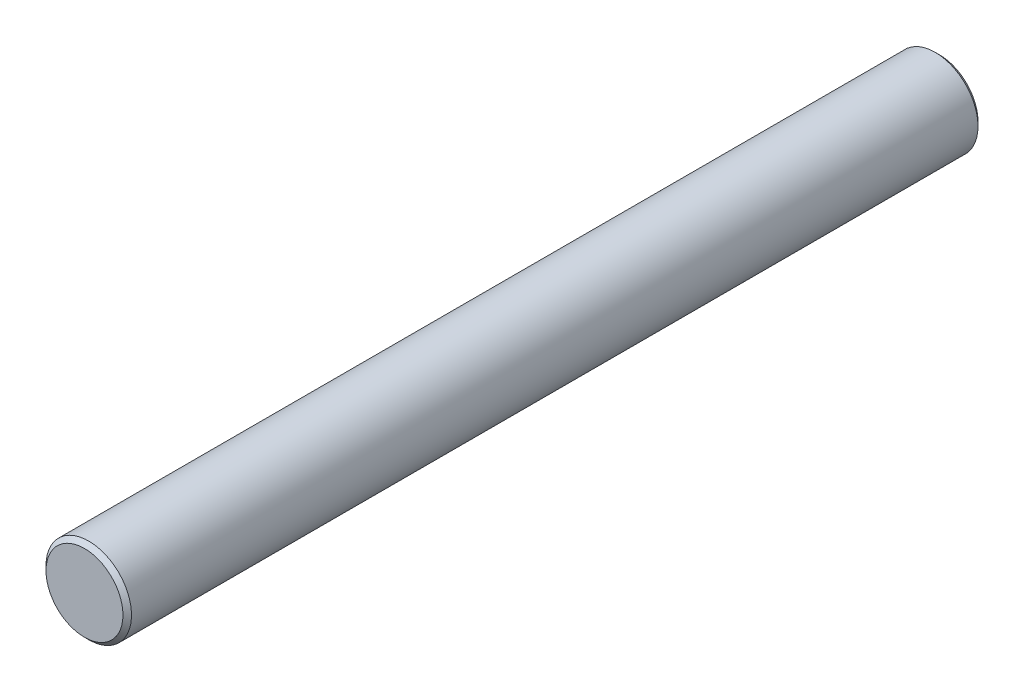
ISO-10303-21;
HEADER;
FILE_DESCRIPTION(('STEP AP214'),'2;1');
FILE_NAME('part.step','',(''),(''),'','','');
FILE_SCHEMA(('AUTOMOTIVE_DESIGN { 1 0 10303 214 1 1 1 1 }'));
ENDSEC;
DATA;
#1=APPLICATION_CONTEXT('core data for automotive mechanical design processes');
#2=APPLICATION_PROTOCOL_DEFINITION('international standard','automotive_design',2000,#1);
#3=PRODUCT_CONTEXT('',#1,'mechanical');
#4=PRODUCT('Part','Part','',(#3));
#5=PRODUCT_RELATED_PRODUCT_CATEGORY('part','',(#4));
#6=PRODUCT_DEFINITION_FORMATION('','',#4);
#7=PRODUCT_DEFINITION_CONTEXT('part definition',#1,'design');
#8=PRODUCT_DEFINITION('design','',#6,#7);
#9=PRODUCT_DEFINITION_SHAPE('','',#8);
#10=(LENGTH_UNIT() NAMED_UNIT(*) SI_UNIT(.MILLI.,.METRE.));
#11=(NAMED_UNIT(*) PLANE_ANGLE_UNIT() SI_UNIT($,.RADIAN.));
#12=(NAMED_UNIT(*) SI_UNIT($,.STERADIAN.) SOLID_ANGLE_UNIT());
#13=UNCERTAINTY_MEASURE_WITH_UNIT(LENGTH_MEASURE(1.E-05),#10,'distance_accuracy_value','');
#14=(GEOMETRIC_REPRESENTATION_CONTEXT(3) GLOBAL_UNCERTAINTY_ASSIGNED_CONTEXT((#13)) GLOBAL_UNIT_ASSIGNED_CONTEXT((#10,
#11,#12)) REPRESENTATION_CONTEXT('',''));
#15=CARTESIAN_POINT('',(0.,0.,0.));
#16=DIRECTION('',(0.,0.,1.));
#17=DIRECTION('',(1.,0.,0.));
#18=AXIS2_PLACEMENT_3D('',#15,#16,#17);
#19=CARTESIAN_POINT('',(0.,0.,100.));
#20=DIRECTION('',(0.,0.,-1.));
#21=DIRECTION('',(-1.,0.,0.));
#22=AXIS2_PLACEMENT_3D('',#19,#20,#21);
#23=CYLINDRICAL_SURFACE('',#22,5.);
#24=CARTESIAN_POINT('',(0.,0.,0.500000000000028));
#25=DIRECTION('',(0.,0.,1.));
#26=DIRECTION('',(1.,0.,0.));
#27=AXIS2_PLACEMENT_3D('',#24,#25,#26);
#28=CIRCLE('',#27,5.);
#29=CARTESIAN_POINT('',(-5.,0.,0.500000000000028));
#30=VERTEX_POINT('',#29);
#31=EDGE_CURVE('E356',#30,#30,#28,.T.);
#32=CARTESIAN_POINT('',(0.,0.,99.5));
#33=DIRECTION('',(0.,0.,1.));
#34=DIRECTION('',(1.,0.,0.));
#35=AXIS2_PLACEMENT_3D('',#32,#33,#34);
#36=CIRCLE('',#35,5.);
#37=CARTESIAN_POINT('',(-5.,0.,99.5));
#38=VERTEX_POINT('',#37);
#39=EDGE_CURVE('E360',#38,#38,#36,.F.);
#40=CARTESIAN_POINT('',(-5.,0.,0.500000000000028));
#41=CARTESIAN_POINT('',(-5.,0.,1.53125000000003));
#42=CARTESIAN_POINT('',(-5.,0.,2.56250000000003));
#43=CARTESIAN_POINT('',(-5.,0.,4.62500000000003));
#44=CARTESIAN_POINT('',(-5.,0.,5.65625000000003));
#45=CARTESIAN_POINT('',(-5.,0.,7.71875000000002));
#46=CARTESIAN_POINT('',(-5.,0.,8.75000000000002));
#47=CARTESIAN_POINT('',(-5.,0.,10.8125));
#48=CARTESIAN_POINT('',(-5.,0.,11.84375));
#49=CARTESIAN_POINT('',(-5.,0.,13.90625));
#50=CARTESIAN_POINT('',(-5.,0.,14.9375));
#51=CARTESIAN_POINT('',(-5.,0.,17.));
#52=CARTESIAN_POINT('',(-5.,0.,18.03125));
#53=CARTESIAN_POINT('',(-5.,0.,20.09375));
#54=CARTESIAN_POINT('',(-5.,0.,21.125));
#55=CARTESIAN_POINT('',(-5.,0.,23.1875));
#56=CARTESIAN_POINT('',(-5.,0.,24.21875));
#57=CARTESIAN_POINT('',(-5.,0.,26.28125));
#58=CARTESIAN_POINT('',(-5.,0.,27.3125));
#59=CARTESIAN_POINT('',(-5.,0.,29.375));
#60=CARTESIAN_POINT('',(-5.,0.,30.40625));
#61=CARTESIAN_POINT('',(-5.,0.,32.46875));
#62=CARTESIAN_POINT('',(-5.,0.,33.5));
#63=CARTESIAN_POINT('',(-5.,0.,35.5625));
#64=CARTESIAN_POINT('',(-5.,0.,36.59375));
#65=CARTESIAN_POINT('',(-5.,0.,38.65625));
#66=CARTESIAN_POINT('',(-5.,0.,39.6875));
#67=CARTESIAN_POINT('',(-5.,0.,41.75));
#68=CARTESIAN_POINT('',(-5.,0.,42.78125));
#69=CARTESIAN_POINT('',(-5.,0.,44.84375));
#70=CARTESIAN_POINT('',(-5.,0.,45.875));
#71=CARTESIAN_POINT('',(-5.,0.,47.9375));
#72=CARTESIAN_POINT('',(-5.,0.,48.96875));
#73=CARTESIAN_POINT('',(-5.,0.,51.03125));
#74=CARTESIAN_POINT('',(-5.,0.,52.0625));
#75=CARTESIAN_POINT('',(-5.,0.,54.125));
#76=CARTESIAN_POINT('',(-5.,0.,55.15625));
#77=CARTESIAN_POINT('',(-5.,0.,57.21875));
#78=CARTESIAN_POINT('',(-5.,0.,58.25));
#79=CARTESIAN_POINT('',(-5.,0.,60.3125));
#80=CARTESIAN_POINT('',(-5.,0.,61.34375));
#81=CARTESIAN_POINT('',(-5.,0.,63.40625));
#82=CARTESIAN_POINT('',(-5.,0.,64.4375));
#83=CARTESIAN_POINT('',(-5.,0.,66.5));
#84=CARTESIAN_POINT('',(-5.,0.,67.53125));
#85=CARTESIAN_POINT('',(-5.,0.,69.59375));
#86=CARTESIAN_POINT('',(-5.,0.,70.625));
#87=CARTESIAN_POINT('',(-5.,0.,72.6875));
#88=CARTESIAN_POINT('',(-5.,0.,73.71875));
#89=CARTESIAN_POINT('',(-5.,0.,75.78125));
#90=CARTESIAN_POINT('',(-5.,0.,76.8125));
#91=CARTESIAN_POINT('',(-5.,0.,78.875));
#92=CARTESIAN_POINT('',(-5.,0.,79.90625));
#93=CARTESIAN_POINT('',(-5.,0.,81.96875));
#94=CARTESIAN_POINT('',(-5.,0.,83.));
#95=CARTESIAN_POINT('',(-5.,0.,85.0625));
#96=CARTESIAN_POINT('',(-5.,0.,86.09375));
#97=CARTESIAN_POINT('',(-5.,0.,88.15625));
#98=CARTESIAN_POINT('',(-5.,0.,89.1875));
#99=CARTESIAN_POINT('',(-5.,0.,91.25));
#100=CARTESIAN_POINT('',(-5.,0.,92.28125));
#101=CARTESIAN_POINT('',(-5.,0.,94.34375));
#102=CARTESIAN_POINT('',(-5.,0.,95.375));
#103=CARTESIAN_POINT('',(-5.,0.,97.4375));
#104=CARTESIAN_POINT('',(-5.,0.,98.46875));
#105=CARTESIAN_POINT('',(-5.,0.,99.5));
#106=B_SPLINE_CURVE_WITH_KNOTS('',3,(#40,#41,#42,#43,#44,#45,#46,#47,#48,#49,#50,#51,#52,#53,
#54,#55,#56,#57,#58,#59,#60,#61,#62,#63,#64,#65,#66,#67,#68,#69,#70,#71,#72,#73,#74,#75,#76,#77,
#78,#79,#80,#81,#82,#83,#84,#85,#86,#87,#88,#89,#90,#91,#92,#93,#94,#95,#96,#97,#98,#99,#100,
#101,#102,#103,#104,#105),.UNSPECIFIED.,.F.,.F.,(4,2,2,2,2,2,2,2,2,2,2,2,2,2,2,2,2,2,2,2,2,2,2,
2,2,2,2,2,2,2,2,2,4),(0.,3.09375000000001,6.1875,9.28124999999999,12.375,15.46875,18.5625,
21.65625,24.75,27.84375,30.9375,34.03125,37.125,40.21875,43.3125,46.40625,49.5,52.59375,55.6875,
58.78125,61.875,64.96875,68.0625,71.15625,74.25,77.34375,80.4375,83.53125,86.625,89.71875,
92.8125,95.90625,99.),.UNSPECIFIED.);
#107=EDGE_CURVE('BSEAM346',#30,#38,#106,.T.);
#108=ORIENTED_EDGE('',*,*,#31,.T.);
#109=ORIENTED_EDGE('',*,*,#39,.T.);
#110=ORIENTED_EDGE('',*,*,#107,.T.);
#111=ORIENTED_EDGE('',*,*,#107,.F.);
#112=EDGE_LOOP('',(#108,#110,#109,#111));
#113=FACE_BOUND('',#112,.T.);
#114=ADVANCED_FACE('F346',(#113),#23,.T.);
#115=CARTESIAN_POINT('',(0.,0.,100.));
#116=DIRECTION('',(0.,0.,1.));
#117=DIRECTION('',(1.,0.,0.));
#118=AXIS2_PLACEMENT_3D('',#115,#116,#117);
#119=PLANE('',#118);
#120=CARTESIAN_POINT('',(0.,0.,100.));
#121=DIRECTION('',(0.,0.,1.));
#122=DIRECTION('',(1.,0.,0.));
#123=AXIS2_PLACEMENT_3D('',#120,#121,#122);
#124=CIRCLE('',#123,4.5);
#125=CARTESIAN_POINT('',(4.5,0.,100.));
#126=VERTEX_POINT('',#125);
#127=EDGE_CURVE('E10',#126,#126,#124,.T.);
#128=ORIENTED_EDGE('',*,*,#127,.T.);
#129=EDGE_LOOP('',(#128));
#130=FACE_BOUND('',#129,.T.);
#131=ADVANCED_FACE('F379',(#130),#119,.T.);
#132=CARTESIAN_POINT('',(0.,0.,0.));
#133=DIRECTION('',(0.,0.,1.));
#134=DIRECTION('',(1.,0.,0.));
#135=AXIS2_PLACEMENT_3D('',#132,#133,#134);
#136=PLANE('',#135);
#137=CARTESIAN_POINT('',(0.,0.,0.));
#138=DIRECTION('',(0.,0.,1.));
#139=DIRECTION('',(1.,0.,0.));
#140=AXIS2_PLACEMENT_3D('',#137,#138,#139);
#141=CIRCLE('',#140,4.49999999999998);
#142=CARTESIAN_POINT('',(4.49999999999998,0.,0.));
#143=VERTEX_POINT('',#142);
#144=EDGE_CURVE('E352',#143,#143,#141,.F.);
#145=ORIENTED_EDGE('',*,*,#144,.T.);
#146=EDGE_LOOP('',(#145));
#147=FACE_BOUND('',#146,.T.);
#148=ADVANCED_FACE('F375',(#147),#136,.F.);
#149=CARTESIAN_POINT('',(0.,0.,0.500000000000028));
#150=DIRECTION('',(0.,0.,1.));
#151=DIRECTION('',(1.,0.,0.));
#152=AXIS2_PLACEMENT_3D('',#149,#150,#151);
#153=CONICAL_SURFACE('',#152,5.,0.785398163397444);
#154=ORIENTED_EDGE('',*,*,#144,.F.);
#155=EDGE_LOOP('',(#154));
#156=FACE_BOUND('',#155,.T.);
#157=ORIENTED_EDGE('',*,*,#31,.F.);
#158=EDGE_LOOP('',(#157));
#159=FACE_BOUND('',#158,.T.);
#160=ADVANCED_FACE('F370',(#156,#159),#153,.T.);
#161=CARTESIAN_POINT('',(0.,0.,100.));
#162=DIRECTION('',(0.,0.,-1.));
#163=DIRECTION('',(-1.,0.,0.));
#164=AXIS2_PLACEMENT_3D('',#161,#162,#163);
#165=CONICAL_SURFACE('',#164,4.5,0.785398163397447);
#166=ORIENTED_EDGE('',*,*,#39,.F.);
#167=EDGE_LOOP('',(#166));
#168=FACE_BOUND('',#167,.T.);
#169=ORIENTED_EDGE('',*,*,#127,.F.);
#170=EDGE_LOOP('',(#169));
#171=FACE_BOUND('',#170,.T.);
#172=ADVANCED_FACE('F367',(#168,#171),#165,.T.);
#173=CLOSED_SHELL('',(#114,#131,#148,#160,#172));
#174=MANIFOLD_SOLID_BREP('B2',#173);
#175=ADVANCED_BREP_SHAPE_REPRESENTATION('',(#18,#174),#14);
#176=SHAPE_DEFINITION_REPRESENTATION(#9,#175);
ENDSEC;
END-ISO-10303-21;
